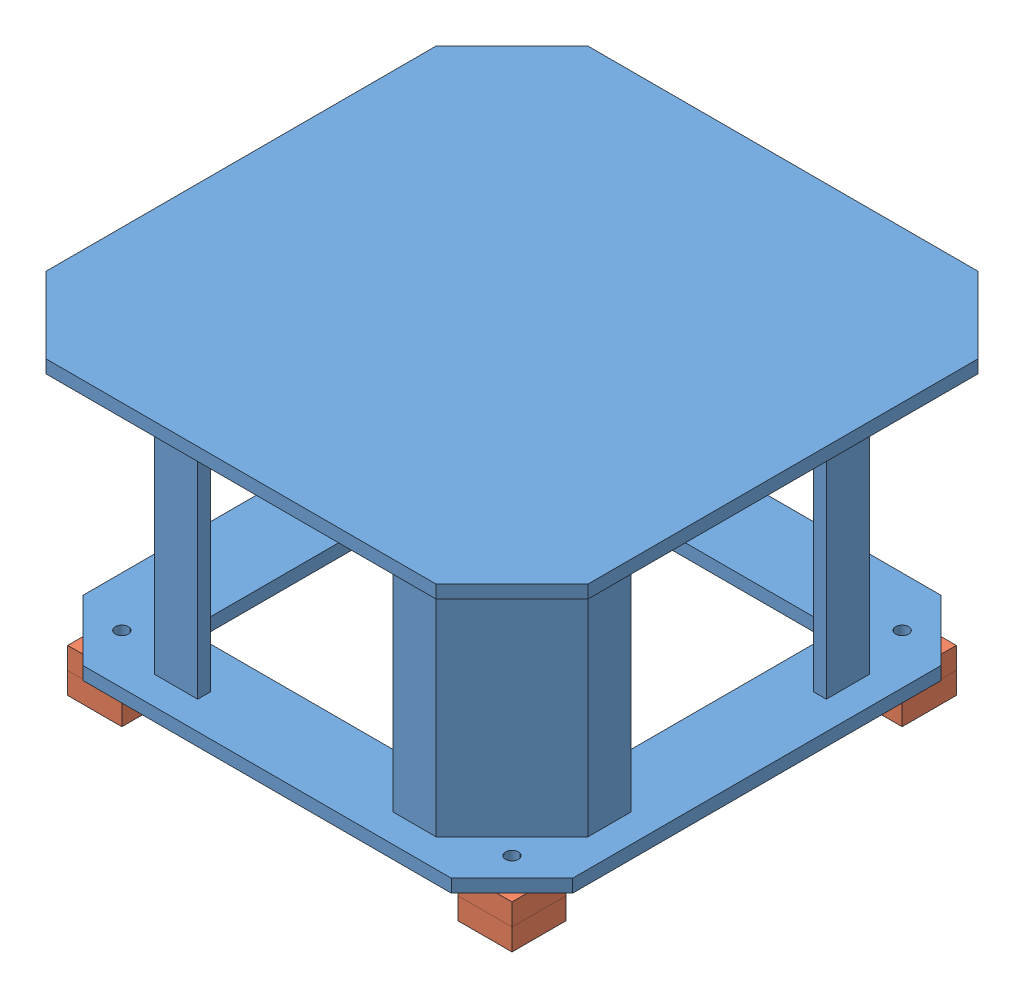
SolidWorks assembly Indexing_Table.SLDASM, configuration Default (file format 5000). Lengths in mm.
Overall size (250 152 250).
9 component instances, 2 part files, 23 mates.
Components (placement in the parent):
- Table -top-1: Table -top.SLDPRT [Default] at (-72.6181 32.1889 16.451) size (250 132 250)
- bottom-plate-1: bottom-plate.SLDPRT [Default] at (-162.6181 -103.8111 106.451) size (25 10 25)
- bottom-plate-2: bottom-plate.SLDPRT [Default] at (17.3819 -103.8111 106.451) size (25 10 25)
- bottom-plate-3: bottom-plate.SLDPRT [Default] at (17.3819 -103.8111 -73.549) size (25 10 25)
- bottom-plate-4: bottom-plate.SLDPRT [Default] at (-162.6181 -103.8111 -73.549) size (25 10 25)
- bottom-plate-5: bottom-plate.SLDPRT [Default] at (-162.6181 -113.8111 106.451) size (25 10 25)
- bottom-plate-6: bottom-plate.SLDPRT [Default] at (17.3819 -113.8111 106.451) size (25 10 25)
- bottom-plate-7: bottom-plate.SLDPRT [Default] at (17.3819 -113.8111 -73.549) size (25 10 25)
- bottom-plate-8: bottom-plate.SLDPRT [Default] at (-162.6181 -113.8111 -73.549) size (25 10 25)
Mates (geometry in assembly coordinates):
- Coincident2: coincident anti-aligned: plane of Table -top-1 through (-72.6181 -93.8111 16.451) normal (0 -1 0); plane of bottom-plate-1 through (-162.6181 -93.8111 106.451) normal (0 1 0)
- Concentric2: concentric aligned: cylinder of Table -top-1 through (-162.6181 -93.8121 106.451) axis (0 1 0) radius 3; cylinder of bottom-plate-1 through (-162.6181 -103.8121 106.451) axis (0 1 0) radius 3
- Concentric3: concentric aligned: cylinder of Table -top-1 through (17.3819 -93.8121 106.451) axis (0 1 0) radius 3; cylinder of bottom-plate-2 through (17.3819 -103.8121 106.451) axis (0 1 0) radius 3
- Coincident3: coincident anti-aligned: plane of Table -top-1 through (-72.6181 -93.8111 16.451) normal (0 -1 0); plane of bottom-plate-2 through (17.3819 -93.8111 106.451) normal (0 1 0)
- Coincident4: coincident aligned: plane of bottom-plate-1 through (-175.1181 -93.8111 118.951) normal (0 0 1); plane of bottom-plate-2 through (4.8819 -93.8111 118.951) normal (0 0 1)
- Coincident5: coincident anti-aligned: plane of Table -top-1 through (-72.6181 -93.8111 16.451) normal (0 -1 0); plane of bottom-plate-3 through (17.3819 -93.8111 -73.549) normal (0 1 0)
- Concentric4: concentric aligned: cylinder of Table -top-1 through (17.3819 -93.8121 -73.549) axis (0 1 0) radius 3; cylinder of bottom-plate-3 through (17.3819 -103.8121 -73.549) axis (0 1 0) radius 3
- Coincident6: coincident aligned: plane of bottom-plate-2 through (29.8819 -93.8111 118.951) normal (1 0 0); plane of bottom-plate-3 through (29.8819 -93.8111 -61.049) normal (1 0 0)
- Coincident7: coincident anti-aligned: plane of Table -top-1 through (-72.6181 -93.8111 16.451) normal (0 -1 0); plane of bottom-plate-4 through (-162.6181 -93.8111 -73.549) normal (0 1 0)
- Concentric5: concentric aligned: cylinder of Table -top-1 through (-162.6181 -93.8121 -73.549) axis (0 1 0) radius 3; cylinder of bottom-plate-4 through (-162.6181 -103.8121 -73.549) axis (0 1 0) radius 3
- Coincident8: coincident aligned: plane of bottom-plate-3 through (4.8819 -93.8111 -86.049) normal (0 0 -1); plane of bottom-plate-4 through (-175.1181 -93.8111 -86.049) normal (0 0 -1)
- Coincident15: coincident anti-aligned: plane of bottom-plate-1 through (-162.6181 -103.8111 106.451) normal (0 -1 0); plane of bottom-plate-5 through (-162.6181 -103.8111 106.451) normal (0 1 0)
- Coincident16: coincident aligned: plane of bottom-plate-1 through (-175.1181 -93.8111 118.951) normal (0 0 1); plane of bottom-plate-5 through (-175.1181 -103.8111 118.951) normal (0 0 1)
- Coincident17: coincident aligned: plane of bottom-plate-1 through (-150.1181 -93.8111 118.951) normal (1 0 0); plane of bottom-plate-5 through (-150.1181 -103.8111 118.951) normal (1 0 0)
- Coincident18: coincident anti-aligned: plane of bottom-plate-2 through (17.3819 -103.8111 106.451) normal (0 -1 0); plane of bottom-plate-6 through (17.3819 -103.8111 106.451) normal (0 1 0)
- Coincident19: coincident aligned: plane of bottom-plate-2 through (4.8819 -93.8111 118.951) normal (0 0 1); plane of bottom-plate-6 through (4.8819 -103.8111 118.951) normal (0 0 1)
- Coincident20: coincident aligned: plane of bottom-plate-2 through (29.8819 -93.8111 118.951) normal (1 0 0); plane of bottom-plate-6 through (29.8819 -103.8111 118.951) normal (1 0 0)
- Coincident21: coincident anti-aligned: plane of bottom-plate-3 through (17.3819 -103.8111 -73.549) normal (0 -1 0); plane of bottom-plate-7 through (17.3819 -103.8111 -73.549) normal (0 1 0)
- Coincident22: coincident aligned: plane of bottom-plate-3 through (4.8819 -93.8111 -86.049) normal (0 0 -1); plane of bottom-plate-7 through (4.8819 -103.8111 -86.049) normal (0 0 -1)
- Coincident23: coincident aligned: plane of bottom-plate-3 through (29.8819 -93.8111 -61.049) normal (1 0 0); plane of bottom-plate-7 through (29.8819 -103.8111 -61.049) normal (1 0 0)
- Coincident24: coincident anti-aligned: plane of bottom-plate-4 through (-162.6181 -103.8111 -73.549) normal (0 -1 0); plane of bottom-plate-8 through (-162.6181 -103.8111 -73.549) normal (0 1 0)
- Coincident25: coincident aligned: plane of bottom-plate-4 through (-175.1181 -93.8111 -86.049) normal (0 0 -1); plane of bottom-plate-8 through (-175.1181 -103.8111 -86.049) normal (0 0 -1)
- Coincident26: coincident aligned: plane of bottom-plate-4 through (-175.1181 -93.8111 -61.049) normal (-1 0 0); plane of bottom-plate-8 through (-175.1181 -103.8111 -61.049) normal (-1 0 0)
